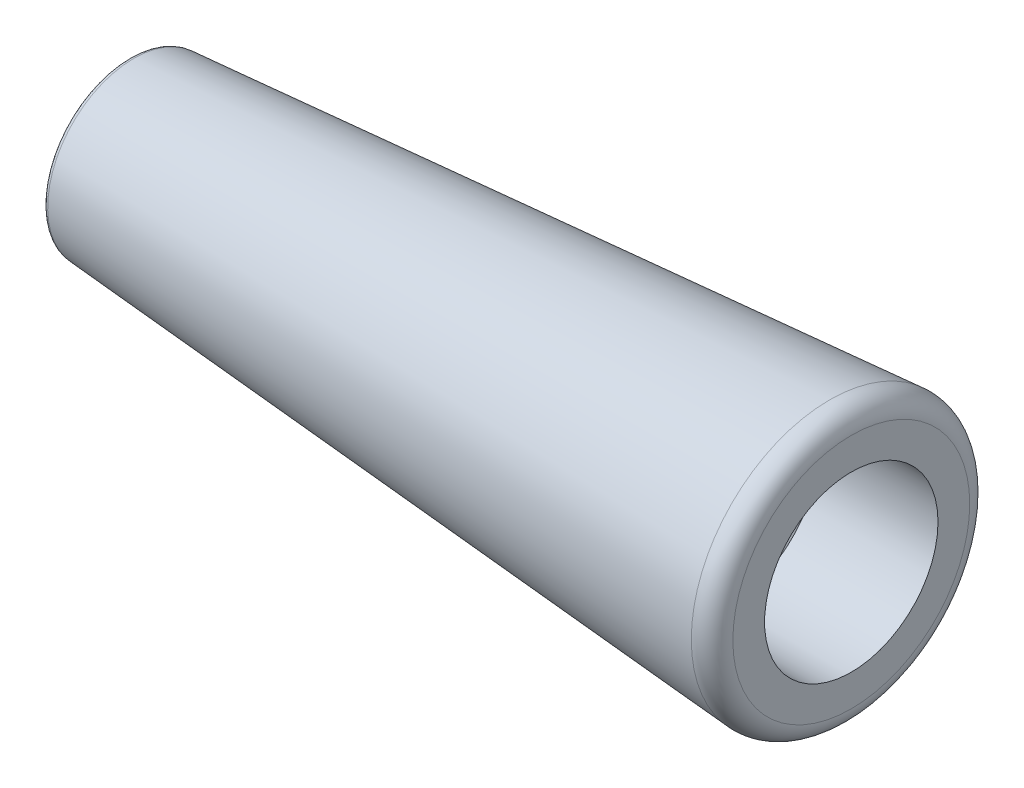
ISO-10303-21;
HEADER;
FILE_DESCRIPTION(('STEP AP214'),'2;1');
FILE_NAME('part.step','',(''),(''),'','','');
FILE_SCHEMA(('AUTOMOTIVE_DESIGN { 1 0 10303 214 1 1 1 1 }'));
ENDSEC;
DATA;
#1=APPLICATION_CONTEXT('core data for automotive mechanical design processes');
#2=APPLICATION_PROTOCOL_DEFINITION('international standard','automotive_design',2000,#1);
#3=PRODUCT_CONTEXT('',#1,'mechanical');
#4=PRODUCT('Part','Part','',(#3));
#5=PRODUCT_RELATED_PRODUCT_CATEGORY('part','',(#4));
#6=PRODUCT_DEFINITION_FORMATION('','',#4);
#7=PRODUCT_DEFINITION_CONTEXT('part definition',#1,'design');
#8=PRODUCT_DEFINITION('design','',#6,#7);
#9=PRODUCT_DEFINITION_SHAPE('','',#8);
#10=(LENGTH_UNIT() NAMED_UNIT(*) SI_UNIT(.MILLI.,.METRE.));
#11=(NAMED_UNIT(*) PLANE_ANGLE_UNIT() SI_UNIT($,.RADIAN.));
#12=(NAMED_UNIT(*) SI_UNIT($,.STERADIAN.) SOLID_ANGLE_UNIT());
#13=UNCERTAINTY_MEASURE_WITH_UNIT(LENGTH_MEASURE(1.E-05),#10,'distance_accuracy_value','');
#14=(GEOMETRIC_REPRESENTATION_CONTEXT(3) GLOBAL_UNCERTAINTY_ASSIGNED_CONTEXT((#13)) GLOBAL_UNIT_ASSIGNED_CONTEXT((#10,
#11,#12)) REPRESENTATION_CONTEXT('',''));
#15=CARTESIAN_POINT('',(0.,0.,0.));
#16=DIRECTION('',(0.,0.,1.));
#17=DIRECTION('',(1.,0.,0.));
#18=AXIS2_PLACEMENT_3D('',#15,#16,#17);
#19=CARTESIAN_POINT('',(60.0000000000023,0.,0.));
#20=DIRECTION('',(1.,0.,0.));
#21=DIRECTION('',(0.,0.,-1.));
#22=AXIS2_PLACEMENT_3D('',#19,#20,#21);
#23=CONICAL_SURFACE('',#22,8.64700000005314,1.02974425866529);
#24=CARTESIAN_POINT('',(60.,0.,0.));
#25=DIRECTION('',(1.,0.,0.));
#26=DIRECTION('',(0.,0.,-1.));
#27=AXIS2_PLACEMENT_3D('',#24,#25,#26);
#28=CIRCLE('',#27,8.647);
#29=CARTESIAN_POINT('',(60.,0.,-8.647));
#30=VERTEX_POINT('',#29);
#31=EDGE_CURVE('E96',#30,#30,#28,.T.);
#32=ORIENTED_EDGE('',*,*,#31,.T.);
#33=EDGE_LOOP('',(#32));
#34=FACE_BOUND('',#33,.T.);
#35=CARTESIAN_POINT('',(59.040425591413,0.,0.));
#36=DIRECTION('',(1.,0.,0.));
#37=DIRECTION('',(0.,0.,-1.));
#38=AXIS2_PLACEMENT_3D('',#35,#36,#37);
#39=CIRCLE('',#38,7.05);
#40=CARTESIAN_POINT('',(59.040425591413,0.,-7.05));
#41=VERTEX_POINT('',#40);
#42=EDGE_CURVE('E112',#41,#41,#39,.F.);
#43=ORIENTED_EDGE('',*,*,#42,.T.);
#44=EDGE_LOOP('',(#43));
#45=FACE_BOUND('',#44,.T.);
#46=ADVANCED_FACE('F14',(#34,#45),#23,.F.);
#47=CARTESIAN_POINT('',(36.,0.,0.));
#48=DIRECTION('',(1.,0.,0.));
#49=DIRECTION('',(0.,0.,-1.));
#50=AXIS2_PLACEMENT_3D('',#47,#48,#49);
#51=CYLINDRICAL_SURFACE('',#50,7.05);
#52=CARTESIAN_POINT('',(0.499999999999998,0.,0.));
#53=DIRECTION('',(1.,0.,0.));
#54=DIRECTION('',(0.,0.,-1.));
#55=AXIS2_PLACEMENT_3D('',#52,#53,#54);
#56=CIRCLE('',#55,7.05);
#57=CARTESIAN_POINT('',(0.499999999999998,0.,-7.05));
#58=VERTEX_POINT('',#57);
#59=EDGE_CURVE('E93',#58,#58,#56,.T.);
#60=ORIENTED_EDGE('',*,*,#59,.F.);
#61=EDGE_LOOP('',(#60));
#62=FACE_BOUND('',#61,.T.);
#63=ORIENTED_EDGE('',*,*,#42,.F.);
#64=EDGE_LOOP('',(#63));
#65=FACE_BOUND('',#64,.T.);
#66=ADVANCED_FACE('F120',(#62,#65),#51,.F.);
#67=CARTESIAN_POINT('',(66.,0.,0.));
#68=DIRECTION('',(1.,0.,0.));
#69=DIRECTION('',(0.,0.,-1.));
#70=AXIS2_PLACEMENT_3D('',#67,#68,#69);
#71=CYLINDRICAL_SURFACE('',#70,8.647);
#72=ORIENTED_EDGE('',*,*,#31,.F.);
#73=EDGE_LOOP('',(#72));
#74=FACE_BOUND('',#73,.T.);
#75=CARTESIAN_POINT('',(72.,0.,0.));
#76=DIRECTION('',(1.,0.,0.));
#77=DIRECTION('',(0.,0.,-1.));
#78=AXIS2_PLACEMENT_3D('',#75,#76,#77);
#79=CIRCLE('',#78,8.647);
#80=CARTESIAN_POINT('',(72.,0.,-8.647));
#81=VERTEX_POINT('',#80);
#82=EDGE_CURVE('E17',#81,#81,#79,.F.);
#83=ORIENTED_EDGE('',*,*,#82,.F.);
#84=EDGE_LOOP('',(#83));
#85=FACE_BOUND('',#84,.T.);
#86=ADVANCED_FACE('F86',(#74,#85),#71,.F.);
#87=CARTESIAN_POINT('',(0.499999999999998,0.,0.));
#88=DIRECTION('',(1.,0.,0.));
#89=DIRECTION('',(0.,0.,-1.));
#90=AXIS2_PLACEMENT_3D('',#87,#88,#89);
#91=TOROIDAL_SURFACE('',#90,7.55,0.5);
#92=CARTESIAN_POINT('',(0.,0.,0.));
#93=DIRECTION('',(-1.,0.,0.));
#94=DIRECTION('',(0.,1.,0.));
#95=AXIS2_PLACEMENT_3D('',#92,#93,#94);
#96=CIRCLE('',#95,7.55);
#97=CARTESIAN_POINT('',(0.,7.55,0.));
#98=VERTEX_POINT('',#97);
#99=EDGE_CURVE('E101',#98,#98,#96,.F.);
#100=ORIENTED_EDGE('',*,*,#99,.F.);
#101=EDGE_LOOP('',(#100));
#102=FACE_BOUND('',#101,.T.);
#103=ORIENTED_EDGE('',*,*,#59,.T.);
#104=EDGE_LOOP('',(#103));
#105=FACE_BOUND('',#104,.T.);
#106=ADVANCED_FACE('F80',(#102,#105),#91,.T.);
#107=CARTESIAN_POINT('',(72.,7.05,0.));
#108=DIRECTION('',(1.,0.,0.));
#109=DIRECTION('',(0.,0.,-1.));
#110=AXIS2_PLACEMENT_3D('',#107,#108,#109);
#111=PLANE('',#110);
#112=CARTESIAN_POINT('',(72.,0.,0.));
#113=DIRECTION('',(-1.,0.,0.));
#114=DIRECTION('',(0.,1.,0.));
#115=AXIS2_PLACEMENT_3D('',#112,#113,#114);
#116=CIRCLE('',#115,11.8076808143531);
#117=CARTESIAN_POINT('',(72.,11.8076808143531,0.));
#118=VERTEX_POINT('',#117);
#119=EDGE_CURVE('E64',#118,#118,#116,.T.);
#120=ORIENTED_EDGE('',*,*,#119,.F.);
#121=EDGE_LOOP('',(#120));
#122=FACE_BOUND('',#121,.T.);
#123=ORIENTED_EDGE('',*,*,#82,.T.);
#124=EDGE_LOOP('',(#123));
#125=FACE_BOUND('',#124,.T.);
#126=ADVANCED_FACE('F70',(#122,#125),#111,.T.);
#127=CARTESIAN_POINT('',(0.,8.55,0.));
#128=DIRECTION('',(-1.,0.,0.));
#129=DIRECTION('',(0.,0.,1.));
#130=AXIS2_PLACEMENT_3D('',#127,#128,#129);
#131=PLANE('',#130);
#132=CARTESIAN_POINT('',(0.,0.,0.));
#133=DIRECTION('',(1.,0.,0.));
#134=DIRECTION('',(0.,1.,0.));
#135=AXIS2_PLACEMENT_3D('',#132,#133,#134);
#136=CIRCLE('',#135,8.08618378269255);
#137=CARTESIAN_POINT('',(0.,8.08618378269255,0.));
#138=VERTEX_POINT('',#137);
#139=EDGE_CURVE('E26',#138,#138,#136,.T.);
#140=ORIENTED_EDGE('',*,*,#139,.F.);
#141=EDGE_LOOP('',(#140));
#142=FACE_BOUND('',#141,.T.);
#143=ORIENTED_EDGE('',*,*,#99,.T.);
#144=EDGE_LOOP('',(#143));
#145=FACE_BOUND('',#144,.T.);
#146=ADVANCED_FACE('F79',(#142,#145),#131,.T.);
#147=CARTESIAN_POINT('',(70.,0.,0.));
#148=DIRECTION('',(1.,0.,0.));
#149=DIRECTION('',(0.,0.,-1.));
#150=AXIS2_PLACEMENT_3D('',#147,#148,#149);
#151=TOROIDAL_SURFACE('',#150,11.8076808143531,2.);
#152=ORIENTED_EDGE('',*,*,#119,.T.);
#153=EDGE_LOOP('',(#152));
#154=FACE_BOUND('',#153,.T.);
#155=CARTESIAN_POINT('',(69.8500425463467,0.,0.));
#156=DIRECTION('',(1.,0.,0.));
#157=DIRECTION('',(0.,1.,0.));
#158=AXIS2_PLACEMENT_3D('',#155,#156,#157);
#159=CIRCLE('',#158,13.8020510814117);
#160=CARTESIAN_POINT('',(69.8500425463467,13.8020510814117,0.));
#161=VERTEX_POINT('',#160);
#162=EDGE_CURVE('E21',#161,#161,#159,.F.);
#163=ORIENTED_EDGE('',*,*,#162,.F.);
#164=EDGE_LOOP('',(#163));
#165=FACE_BOUND('',#164,.T.);
#166=ADVANCED_FACE('F44',(#154,#165),#151,.T.);
#167=CARTESIAN_POINT('',(0.499999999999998,0.,0.));
#168=DIRECTION('',(1.,0.,0.));
#169=DIRECTION('',(0.,0.,-1.));
#170=AXIS2_PLACEMENT_3D('',#167,#168,#169);
#171=TOROIDAL_SURFACE('',#170,8.08618378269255,0.5);
#172=CARTESIAN_POINT('',(0.46251063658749,0.,0.));
#173=DIRECTION('',(1.,0.,0.));
#174=DIRECTION('',(0.,1.,0.));
#175=AXIS2_PLACEMENT_3D('',#172,#173,#174);
#176=CIRCLE('',#175,8.58477634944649);
#177=CARTESIAN_POINT('',(0.46251063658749,8.58477634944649,0.));
#178=VERTEX_POINT('',#177);
#179=EDGE_CURVE('E10',#178,#178,#176,.T.);
#180=ORIENTED_EDGE('',*,*,#179,.F.);
#181=EDGE_LOOP('',(#180));
#182=FACE_BOUND('',#181,.T.);
#183=ORIENTED_EDGE('',*,*,#139,.T.);
#184=EDGE_LOOP('',(#183));
#185=FACE_BOUND('',#184,.T.);
#186=ADVANCED_FACE('F38',(#182,#185),#171,.T.);
#187=CARTESIAN_POINT('',(69.8500425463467,0.,0.));
#188=DIRECTION('',(1.,0.,0.));
#189=DIRECTION('',(0.,0.,-1.));
#190=AXIS2_PLACEMENT_3D('',#187,#188,#189);
#191=CONICAL_SURFACE('',#190,13.8020510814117,0.0750491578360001);
#192=ORIENTED_EDGE('',*,*,#179,.T.);
#193=EDGE_LOOP('',(#192));
#194=FACE_BOUND('',#193,.T.);
#195=ORIENTED_EDGE('',*,*,#162,.T.);
#196=EDGE_LOOP('',(#195));
#197=FACE_BOUND('',#196,.T.);
#198=ADVANCED_FACE('F43',(#194,#197),#191,.T.);
#199=CLOSED_SHELL('',(#46,#66,#86,#106,#126,#146,#166,#186,#198));
#200=MANIFOLD_SOLID_BREP('B1',#199);
#201=ADVANCED_BREP_SHAPE_REPRESENTATION('',(#18,#200),#14);
#202=SHAPE_DEFINITION_REPRESENTATION(#9,#201);
ENDSEC;
END-ISO-10303-21;
